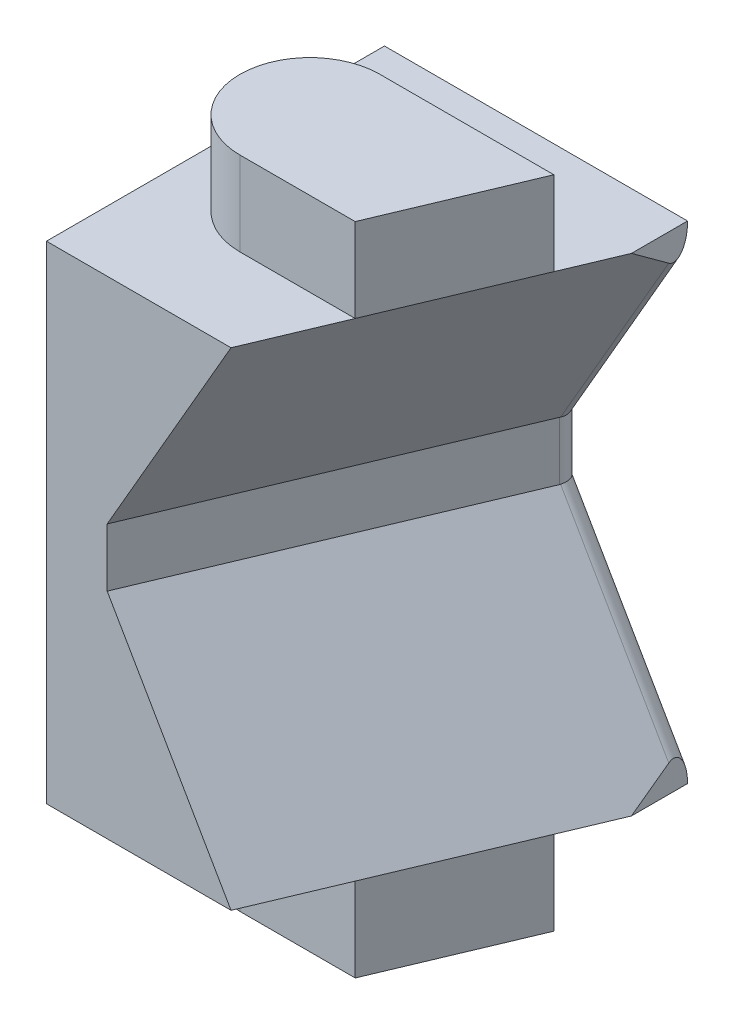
ISO-10303-21;
HEADER;
FILE_DESCRIPTION(('STEP AP214'),'2;1');
FILE_NAME('part.step','',(''),(''),'','','');
FILE_SCHEMA(('AUTOMOTIVE_DESIGN { 1 0 10303 214 1 1 1 1 }'));
ENDSEC;
DATA;
#1=APPLICATION_CONTEXT('core data for automotive mechanical design processes');
#2=APPLICATION_PROTOCOL_DEFINITION('international standard','automotive_design',2000,#1);
#3=PRODUCT_CONTEXT('',#1,'mechanical');
#4=PRODUCT('Part','Part','',(#3));
#5=PRODUCT_RELATED_PRODUCT_CATEGORY('part','',(#4));
#6=PRODUCT_DEFINITION_FORMATION('','',#4);
#7=PRODUCT_DEFINITION_CONTEXT('part definition',#1,'design');
#8=PRODUCT_DEFINITION('design','',#6,#7);
#9=PRODUCT_DEFINITION_SHAPE('','',#8);
#10=(LENGTH_UNIT() NAMED_UNIT(*) SI_UNIT(.MILLI.,.METRE.));
#11=(NAMED_UNIT(*) PLANE_ANGLE_UNIT() SI_UNIT($,.RADIAN.));
#12=(NAMED_UNIT(*) SI_UNIT($,.STERADIAN.) SOLID_ANGLE_UNIT());
#13=UNCERTAINTY_MEASURE_WITH_UNIT(LENGTH_MEASURE(1.E-05),#10,'distance_accuracy_value','');
#14=(GEOMETRIC_REPRESENTATION_CONTEXT(3) GLOBAL_UNCERTAINTY_ASSIGNED_CONTEXT((#13)) GLOBAL_UNIT_ASSIGNED_CONTEXT((#10,
#11,#12)) REPRESENTATION_CONTEXT('',''));
#15=CARTESIAN_POINT('',(0.,0.,0.));
#16=DIRECTION('',(0.,0.,1.));
#17=DIRECTION('',(1.,0.,0.));
#18=AXIS2_PLACEMENT_3D('',#15,#16,#17);
#19=CARTESIAN_POINT('',(11.6726848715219,3.99244557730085,1.2));
#20=DIRECTION('',(0.5,-0.866025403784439,0.));
#21=DIRECTION('',(-0.866025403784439,-0.5,0.));
#22=AXIS2_PLACEMENT_3D('',#19,#20,#21);
#23=CYLINDRICAL_SURFACE('',#22,1.2);
#24=CARTESIAN_POINT('',(15.5938548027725,-2.79921996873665,1.2));
#25=DIRECTION('',(0.258819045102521,-0.965925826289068,0.));
#26=DIRECTION('',(0.965925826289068,0.258819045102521,0.));
#27=AXIS2_PLACEMENT_3D('',#24,#25,#26);
#28=ELLIPSE('',#27,1.2423314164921,1.2);
#29=CARTESIAN_POINT('',(16.7214859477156,-2.49707211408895,1.61042417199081));
#30=VERTEX_POINT('',#29);
#31=CARTESIAN_POINT('',(15.5938548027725,-2.79921996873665,0.));
#32=VERTEX_POINT('',#31);
#33=EDGE_CURVE('E211',#30,#32,#28,.F.);
#34=ORIENTED_EDGE('',*,*,#33,.F.);
#35=DIRECTION('',(0.5,-0.866025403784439,0.));
#36=VECTOR('',#35,1.);
#37=CARTESIAN_POINT('',(22.9635991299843,-13.3087292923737,1.61042417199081));
#38=LINE('',#37,#36);
#39=CARTESIAN_POINT('',(26.,-18.5679298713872,1.61042417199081));
#40=VERTEX_POINT('',#39);
#41=EDGE_CURVE('E264',#40,#30,#38,.F.);
#42=ORIENTED_EDGE('',*,*,#41,.F.);
#43=CARTESIAN_POINT('',(26.,-20.8231921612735,1.2));
#44=DIRECTION('',(1.,0.,0.));
#45=DIRECTION('',(0.,-1.,0.));
#46=AXIS2_PLACEMENT_3D('',#43,#44,#45);
#47=ELLIPSE('',#46,2.4,1.2);
#48=CARTESIAN_POINT('',(26.,-20.8231921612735,0.));
#49=VERTEX_POINT('',#48);
#50=EDGE_CURVE('E267',#49,#40,#47,.T.);
#51=ORIENTED_EDGE('',*,*,#50,.F.);
#52=DIRECTION('',(0.5,-0.866025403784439,0.));
#53=VECTOR('',#52,1.);
#54=CARTESIAN_POINT('',(15.5938548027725,-2.79921996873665,0.));
#55=LINE('',#54,#53);
#56=EDGE_CURVE('E236',#32,#49,#55,.T.);
#57=ORIENTED_EDGE('',*,*,#56,.F.);
#58=EDGE_LOOP('',(#34,#42,#51,#57));
#59=FACE_BOUND('',#58,.T.);
#60=ADVANCED_FACE('F14',(#59),#23,.T.);
#61=CARTESIAN_POINT('',(14.0476676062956,0.121145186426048,1.2));
#62=DIRECTION('',(-0.5,-0.866025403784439,0.));
#63=DIRECTION('',(-0.866025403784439,0.5,0.));
#64=AXIS2_PLACEMENT_3D('',#61,#62,#63);
#65=CYLINDRICAL_SURFACE('',#64,1.2);
#66=CARTESIAN_POINT('',(15.5938548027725,2.79921996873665,1.2));
#67=DIRECTION('',(-0.258819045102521,-0.965925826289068,0.));
#68=DIRECTION('',(0.965925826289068,-0.258819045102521,0.));
#69=AXIS2_PLACEMENT_3D('',#66,#67,#68);
#70=ELLIPSE('',#69,1.2423314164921,1.2);
#71=CARTESIAN_POINT('',(15.5938548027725,2.79921996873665,0.));
#72=VERTEX_POINT('',#71);
#73=CARTESIAN_POINT('',(16.7214859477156,2.49707211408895,1.61042417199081));
#74=VERTEX_POINT('',#73);
#75=EDGE_CURVE('E281',#72,#74,#70,.T.);
#76=ORIENTED_EDGE('',*,*,#75,.F.);
#77=DIRECTION('',(-0.5,-0.866025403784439,0.));
#78=VECTOR('',#77,1.);
#79=CARTESIAN_POINT('',(26.,20.8231921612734,0.));
#80=LINE('',#79,#78);
#81=CARTESIAN_POINT('',(26.,20.8231921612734,0.));
#82=VERTEX_POINT('',#81);
#83=EDGE_CURVE('E230',#82,#72,#80,.T.);
#84=ORIENTED_EDGE('',*,*,#83,.F.);
#85=CARTESIAN_POINT('',(26.,20.8231921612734,1.2));
#86=DIRECTION('',(1.,0.,0.));
#87=DIRECTION('',(0.,-1.,0.));
#88=AXIS2_PLACEMENT_3D('',#85,#86,#87);
#89=ELLIPSE('',#88,2.4,1.2);
#90=CARTESIAN_POINT('',(26.,18.5679298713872,1.61042417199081));
#91=VERTEX_POINT('',#90);
#92=EDGE_CURVE('E283',#91,#82,#89,.T.);
#93=ORIENTED_EDGE('',*,*,#92,.F.);
#94=DIRECTION('',(-0.5,-0.866025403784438,0.));
#95=VECTOR('',#94,1.);
#96=CARTESIAN_POINT('',(9.61363366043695,-9.8140891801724,1.61042417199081));
#97=LINE('',#96,#95);
#98=EDGE_CURVE('E299',#74,#91,#97,.F.);
#99=ORIENTED_EDGE('',*,*,#98,.F.);
#100=EDGE_LOOP('',(#76,#84,#93,#99));
#101=FACE_BOUND('',#100,.T.);
#102=ADVANCED_FACE('F374',(#101),#65,.T.);
#103=CARTESIAN_POINT('',(15.5938548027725,4.6,1.2));
#104=DIRECTION('',(0.,-1.,0.));
#105=DIRECTION('',(-1.,0.,0.));
#106=AXIS2_PLACEMENT_3D('',#103,#104,#105);
#107=CYLINDRICAL_SURFACE('',#106,1.2);
#108=ORIENTED_EDGE('',*,*,#75,.T.);
#109=CARTESIAN_POINT('',(15.5938548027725,0.2451933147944,1.2));
#110=DIRECTION('',(0.813797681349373,-0.469846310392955,0.342020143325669));
#111=DIRECTION('',(-0.433147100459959,-0.882748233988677,-0.182041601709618));
#112=AXIS2_PLACEMENT_3D('',#109,#110,#111);
#113=ELLIPSE('',#112,2.55402665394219,1.2);
#114=CARTESIAN_POINT('',(16.7000905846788,2.4997558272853,1.66501870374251));
#115=VERTEX_POINT('',#114);
#116=EDGE_CURVE('E285',#115,#74,#113,.F.);
#117=ORIENTED_EDGE('',*,*,#116,.F.);
#118=DIRECTION('',(0.,-1.,0.));
#119=VECTOR('',#118,1.);
#120=CARTESIAN_POINT('',(16.7000905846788,-11.7,1.66501870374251));
#121=LINE('',#120,#119);
#122=CARTESIAN_POINT('',(16.7000905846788,-2.4997558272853,1.66501870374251));
#123=VERTEX_POINT('',#122);
#124=EDGE_CURVE('E276',#123,#115,#121,.F.);
#125=ORIENTED_EDGE('',*,*,#124,.F.);
#126=CARTESIAN_POINT('',(15.5938548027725,-0.245193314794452,1.2));
#127=DIRECTION('',(0.813797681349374,0.469846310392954,0.342020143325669));
#128=DIRECTION('',(0.433147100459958,-0.882748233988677,0.182041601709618));
#129=AXIS2_PLACEMENT_3D('',#126,#127,#128);
#130=ELLIPSE('',#129,2.55402665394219,1.2);
#131=EDGE_CURVE('E266',#30,#123,#130,.F.);
#132=ORIENTED_EDGE('',*,*,#131,.F.);
#133=ORIENTED_EDGE('',*,*,#33,.T.);
#134=DIRECTION('',(0.,-1.,0.));
#135=VECTOR('',#134,1.);
#136=CARTESIAN_POINT('',(15.5938548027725,20.9,0.));
#137=LINE('',#136,#135);
#138=EDGE_CURVE('E232',#72,#32,#137,.T.);
#139=ORIENTED_EDGE('',*,*,#138,.F.);
#140=EDGE_LOOP('',(#108,#117,#125,#132,#133,#139));
#141=FACE_BOUND('',#140,.T.);
#142=ADVANCED_FACE('F381',(#141),#107,.T.);
#143=CARTESIAN_POINT('',(26.,0.,14.5));
#144=DIRECTION('',(1.,0.,0.));
#145=DIRECTION('',(0.,-1.,0.));
#146=AXIS2_PLACEMENT_3D('',#143,#144,#145);
#147=PLANE('',#146);
#148=DIRECTION('',(0.,0.,-1.));
#149=VECTOR('',#148,1.);
#150=CARTESIAN_POINT('',(26.,20.9,29.));
#151=LINE('',#150,#149);
#152=CARTESIAN_POINT('',(26.,20.9,4.81407918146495));
#153=VERTEX_POINT('',#152);
#154=CARTESIAN_POINT('',(26.,20.9,0.));
#155=VERTEX_POINT('',#154);
#156=EDGE_CURVE('E244',#153,#155,#151,.T.);
#157=ORIENTED_EDGE('',*,*,#156,.F.);
#158=DIRECTION('',(0.,0.588524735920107,0.808479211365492));
#159=VECTOR('',#158,1.);
#160=CARTESIAN_POINT('',(26.,18.5679298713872,1.61042417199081));
#161=LINE('',#160,#159);
#162=EDGE_CURVE('E296',#91,#153,#161,.T.);
#163=ORIENTED_EDGE('',*,*,#162,.F.);
#164=ORIENTED_EDGE('',*,*,#92,.T.);
#165=DIRECTION('',(0.,-1.,0.));
#166=VECTOR('',#165,1.);
#167=CARTESIAN_POINT('',(26.,20.9,0.));
#168=LINE('',#167,#166);
#169=EDGE_CURVE('E233',#155,#82,#168,.T.);
#170=ORIENTED_EDGE('',*,*,#169,.F.);
#171=EDGE_LOOP('',(#157,#163,#164,#170));
#172=FACE_BOUND('',#171,.T.);
#173=ADVANCED_FACE('F422',(#172),#147,.T.);
#174=CARTESIAN_POINT('',(11.3047612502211,-11.7,14.5));
#175=DIRECTION('',(0.921863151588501,0.,0.387515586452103));
#176=DIRECTION('',(-0.387515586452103,0.,0.921863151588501));
#177=AXIS2_PLACEMENT_3D('',#174,#175,#176);
#178=PLANE('',#177);
#179=DIRECTION('',(0.,-1.,0.));
#180=VECTOR('',#179,1.);
#181=CARTESIAN_POINT('',(5.20952250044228,-20.9,29.));
#182=LINE('',#181,#180);
#183=CARTESIAN_POINT('',(5.20952250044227,-2.49574718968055,29.));
#184=VERTEX_POINT('',#183);
#185=CARTESIAN_POINT('',(5.20952250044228,2.49574718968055,29.));
#186=VERTEX_POINT('',#185);
#187=EDGE_CURVE('E228',#184,#186,#182,.F.);
#188=ORIENTED_EDGE('',*,*,#187,.F.);
#189=DIRECTION('',(-0.387515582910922,0.000135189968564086,0.921863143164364));
#190=VECTOR('',#189,1.);
#191=CARTESIAN_POINT('',(16.7000905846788,-2.49975582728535,1.66501870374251));
#192=LINE('',#191,#190);
#193=EDGE_CURVE('E270',#123,#184,#192,.T.);
#194=ORIENTED_EDGE('',*,*,#193,.F.);
#195=ORIENTED_EDGE('',*,*,#124,.T.);
#196=DIRECTION('',(0.387515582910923,0.000135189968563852,-0.921863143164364));
#197=VECTOR('',#196,1.);
#198=CARTESIAN_POINT('',(5.20952250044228,2.49574718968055,29.));
#199=LINE('',#198,#197);
#200=EDGE_CURVE('E288',#186,#115,#199,.T.);
#201=ORIENTED_EDGE('',*,*,#200,.F.);
#202=EDGE_LOOP('',(#188,#194,#195,#201));
#203=FACE_BOUND('',#202,.T.);
#204=ADVANCED_FACE('F324',(#203),#178,.T.);
#205=CARTESIAN_POINT('',(5.55074308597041,-7.46837821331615,14.5));
#206=DIRECTION('',(0.813797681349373,-0.469846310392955,0.342020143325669));
#207=DIRECTION('',(-0.5,-0.866025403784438,0.));
#208=AXIS2_PLACEMENT_3D('',#205,#206,#207);
#209=PLANE('',#208);
#210=ORIENTED_EDGE('',*,*,#200,.T.);
#211=ORIENTED_EDGE('',*,*,#116,.T.);
#212=ORIENTED_EDGE('',*,*,#98,.T.);
#213=ORIENTED_EDGE('',*,*,#162,.T.);
#214=DIRECTION('',(0.387449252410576,0.,-0.921891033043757));
#215=VECTOR('',#214,1.);
#216=CARTESIAN_POINT('',(15.8352228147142,20.9,29.));
#217=LINE('',#216,#215);
#218=CARTESIAN_POINT('',(24.0306170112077,20.9,9.5));
#219=VERTEX_POINT('',#218);
#220=EDGE_CURVE('E18',#219,#153,#217,.T.);
#221=ORIENTED_EDGE('',*,*,#220,.F.);
#222=DIRECTION('',(-0.387449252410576,0.,0.921891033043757));
#223=VECTOR('',#222,1.);
#224=CARTESIAN_POINT('',(18.9872975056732,20.9,21.5));
#225=LINE('',#224,#223);
#226=CARTESIAN_POINT('',(18.9872975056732,20.9,21.5));
#227=VERTEX_POINT('',#226);
#228=EDGE_CURVE('E175',#219,#227,#225,.T.);
#229=ORIENTED_EDGE('',*,*,#228,.T.);
#230=CARTESIAN_POINT('',(15.8352228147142,20.9,29.));
#231=VERTEX_POINT('',#230);
#232=EDGE_CURVE('E246',#231,#227,#217,.T.);
#233=ORIENTED_EDGE('',*,*,#232,.F.);
#234=DIRECTION('',(0.5,0.866025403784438,0.));
#235=VECTOR('',#234,1.);
#236=CARTESIAN_POINT('',(5.20952250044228,2.49574718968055,29.));
#237=LINE('',#236,#235);
#238=EDGE_CURVE('E224',#186,#231,#237,.T.);
#239=ORIENTED_EDGE('',*,*,#238,.F.);
#240=EDGE_LOOP('',(#210,#211,#212,#213,#221,#229,#233,#239));
#241=FACE_BOUND('',#240,.T.);
#242=ADVANCED_FACE('F329',(#241),#209,.T.);
#243=CARTESIAN_POINT('',(26.,0.,14.5));
#244=DIRECTION('',(1.,0.,0.));
#245=DIRECTION('',(0.,-1.,0.));
#246=AXIS2_PLACEMENT_3D('',#243,#244,#245);
#247=PLANE('',#246);
#248=DIRECTION('',(0.,0.,-1.));
#249=VECTOR('',#248,1.);
#250=CARTESIAN_POINT('',(26.,-20.9,0.));
#251=LINE('',#250,#249);
#252=CARTESIAN_POINT('',(26.,-20.9,0.));
#253=VERTEX_POINT('',#252);
#254=CARTESIAN_POINT('',(26.,-20.9,4.8140791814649));
#255=VERTEX_POINT('',#254);
#256=EDGE_CURVE('E257',#253,#255,#251,.F.);
#257=ORIENTED_EDGE('',*,*,#256,.F.);
#258=DIRECTION('',(0.,-1.,0.));
#259=VECTOR('',#258,1.);
#260=CARTESIAN_POINT('',(26.,20.9,0.));
#261=LINE('',#260,#259);
#262=EDGE_CURVE('E238',#49,#253,#261,.T.);
#263=ORIENTED_EDGE('',*,*,#262,.F.);
#264=ORIENTED_EDGE('',*,*,#50,.T.);
#265=DIRECTION('',(0.,0.588524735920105,-0.808479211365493));
#266=VECTOR('',#265,1.);
#267=CARTESIAN_POINT('',(26.,-20.9,4.81407918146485));
#268=LINE('',#267,#266);
#269=EDGE_CURVE('E239',#255,#40,#268,.T.);
#270=ORIENTED_EDGE('',*,*,#269,.F.);
#271=EDGE_LOOP('',(#257,#263,#264,#270));
#272=FACE_BOUND('',#271,.T.);
#273=ADVANCED_FACE('F433',(#272),#247,.T.);
#274=CARTESIAN_POINT('',(18.9007085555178,-15.65444025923,14.5));
#275=DIRECTION('',(0.813797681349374,0.469846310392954,0.342020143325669));
#276=DIRECTION('',(0.5,-0.866025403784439,0.));
#277=AXIS2_PLACEMENT_3D('',#274,#275,#276);
#278=PLANE('',#277);
#279=DIRECTION('',(-0.387449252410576,0.,0.921891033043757));
#280=VECTOR('',#279,1.);
#281=CARTESIAN_POINT('',(26.,-20.9,4.8140791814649));
#282=LINE('',#281,#280);
#283=CARTESIAN_POINT('',(24.0306170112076,-20.9,9.5));
#284=VERTEX_POINT('',#283);
#285=EDGE_CURVE('E219',#255,#284,#282,.T.);
#286=ORIENTED_EDGE('',*,*,#285,.F.);
#287=ORIENTED_EDGE('',*,*,#269,.T.);
#288=ORIENTED_EDGE('',*,*,#41,.T.);
#289=ORIENTED_EDGE('',*,*,#131,.T.);
#290=ORIENTED_EDGE('',*,*,#193,.T.);
#291=DIRECTION('',(-0.5,0.866025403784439,0.));
#292=VECTOR('',#291,1.);
#293=CARTESIAN_POINT('',(15.8352228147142,-20.9,29.));
#294=LINE('',#293,#292);
#295=CARTESIAN_POINT('',(15.8352228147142,-20.9,29.));
#296=VERTEX_POINT('',#295);
#297=EDGE_CURVE('E225',#296,#184,#294,.T.);
#298=ORIENTED_EDGE('',*,*,#297,.F.);
#299=CARTESIAN_POINT('',(18.9872975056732,-20.9,21.5));
#300=VERTEX_POINT('',#299);
#301=EDGE_CURVE('E261',#300,#296,#282,.T.);
#302=ORIENTED_EDGE('',*,*,#301,.F.);
#303=DIRECTION('',(0.387449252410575,0.,-0.921891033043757));
#304=VECTOR('',#303,1.);
#305=CARTESIAN_POINT('',(18.9872975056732,-20.9,21.5));
#306=LINE('',#305,#304);
#307=EDGE_CURVE('E184',#300,#284,#306,.T.);
#308=ORIENTED_EDGE('',*,*,#307,.T.);
#309=EDGE_LOOP('',(#286,#287,#288,#289,#290,#298,#302,#308));
#310=FACE_BOUND('',#309,.T.);
#311=ADVANCED_FACE('F314',(#310),#278,.T.);
#312=CARTESIAN_POINT('',(-0.3,20.9,0.));
#313=DIRECTION('',(0.,0.,-1.));
#314=DIRECTION('',(1.,0.,0.));
#315=AXIS2_PLACEMENT_3D('',#312,#313,#314);
#316=PLANE('',#315);
#317=ORIENTED_EDGE('',*,*,#262,.T.);
#318=DIRECTION('',(-1.,0.,0.));
#319=VECTOR('',#318,1.);
#320=CARTESIAN_POINT('',(-0.3,-20.9,0.));
#321=LINE('',#320,#319);
#322=CARTESIAN_POINT('',(0.,-20.9,0.));
#323=VERTEX_POINT('',#322);
#324=EDGE_CURVE('E223',#323,#253,#321,.F.);
#325=ORIENTED_EDGE('',*,*,#324,.F.);
#326=DIRECTION('',(0.,-1.,0.));
#327=VECTOR('',#326,1.);
#328=CARTESIAN_POINT('',(0.,23.2745305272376,0.));
#329=LINE('',#328,#327);
#330=CARTESIAN_POINT('',(0.,20.9,0.));
#331=VERTEX_POINT('',#330);
#332=EDGE_CURVE('E180',#331,#323,#329,.T.);
#333=ORIENTED_EDGE('',*,*,#332,.F.);
#334=DIRECTION('',(1.,0.,0.));
#335=VECTOR('',#334,1.);
#336=CARTESIAN_POINT('',(-0.3,20.9,0.));
#337=LINE('',#336,#335);
#338=EDGE_CURVE('E229',#155,#331,#337,.F.);
#339=ORIENTED_EDGE('',*,*,#338,.F.);
#340=ORIENTED_EDGE('',*,*,#169,.T.);
#341=ORIENTED_EDGE('',*,*,#83,.T.);
#342=ORIENTED_EDGE('',*,*,#138,.T.);
#343=ORIENTED_EDGE('',*,*,#56,.T.);
#344=EDGE_LOOP('',(#317,#325,#333,#339,#340,#341,#342,#343));
#345=FACE_BOUND('',#344,.T.);
#346=ADVANCED_FACE('F426',(#345),#316,.T.);
#347=CARTESIAN_POINT('',(-0.3,20.9,29.));
#348=DIRECTION('',(0.,1.,0.));
#349=DIRECTION('',(1.,0.,0.));
#350=AXIS2_PLACEMENT_3D('',#347,#348,#349);
#351=PLANE('',#350);
#352=DIRECTION('',(1.,0.,0.));
#353=VECTOR('',#352,1.);
#354=CARTESIAN_POINT('',(9.1,20.9,9.5));
#355=LINE('',#354,#353);
#356=CARTESIAN_POINT('',(9.1,20.9,9.5));
#357=VERTEX_POINT('',#356);
#358=EDGE_CURVE('E412',#357,#219,#355,.T.);
#359=ORIENTED_EDGE('',*,*,#358,.T.);
#360=ORIENTED_EDGE('',*,*,#220,.T.);
#361=ORIENTED_EDGE('',*,*,#156,.T.);
#362=ORIENTED_EDGE('',*,*,#338,.T.);
#363=DIRECTION('',(0.,0.,-1.));
#364=VECTOR('',#363,1.);
#365=CARTESIAN_POINT('',(0.,20.9,14.5));
#366=LINE('',#365,#364);
#367=CARTESIAN_POINT('',(0.,20.9,29.));
#368=VERTEX_POINT('',#367);
#369=EDGE_CURVE('E215',#331,#368,#366,.F.);
#370=ORIENTED_EDGE('',*,*,#369,.T.);
#371=DIRECTION('',(-1.,0.,0.));
#372=VECTOR('',#371,1.);
#373=CARTESIAN_POINT('',(-0.3,20.9,29.));
#374=LINE('',#373,#372);
#375=EDGE_CURVE('E220',#231,#368,#374,.T.);
#376=ORIENTED_EDGE('',*,*,#375,.F.);
#377=ORIENTED_EDGE('',*,*,#232,.T.);
#378=DIRECTION('',(-1.,0.,0.));
#379=VECTOR('',#378,1.);
#380=CARTESIAN_POINT('',(9.1,20.9,21.5));
#381=LINE('',#380,#379);
#382=CARTESIAN_POINT('',(9.1,20.9,21.5));
#383=VERTEX_POINT('',#382);
#384=EDGE_CURVE('E37',#227,#383,#381,.T.);
#385=ORIENTED_EDGE('',*,*,#384,.T.);
#386=CARTESIAN_POINT('',(9.1,20.9,15.5));
#387=DIRECTION('',(0.,1.,0.));
#388=DIRECTION('',(1.,0.,0.));
#389=AXIS2_PLACEMENT_3D('',#386,#387,#388);
#390=CIRCLE('',#389,6.);
#391=EDGE_CURVE('E32',#383,#357,#390,.F.);
#392=ORIENTED_EDGE('',*,*,#391,.T.);
#393=EDGE_LOOP('',(#359,#360,#361,#362,#370,#376,#377,#385,#392));
#394=FACE_BOUND('',#393,.T.);
#395=ADVANCED_FACE('F418',(#394),#351,.T.);
#396=CARTESIAN_POINT('',(-0.3,-20.9,29.));
#397=DIRECTION('',(0.,0.,1.));
#398=DIRECTION('',(-1.,0.,0.));
#399=AXIS2_PLACEMENT_3D('',#396,#397,#398);
#400=PLANE('',#399);
#401=ORIENTED_EDGE('',*,*,#238,.T.);
#402=ORIENTED_EDGE('',*,*,#375,.T.);
#403=DIRECTION('',(0.,-1.,0.));
#404=VECTOR('',#403,1.);
#405=CARTESIAN_POINT('',(0.,0.,29.));
#406=LINE('',#405,#404);
#407=CARTESIAN_POINT('',(0.,-20.9,29.));
#408=VERTEX_POINT('',#407);
#409=EDGE_CURVE('E24',#368,#408,#406,.T.);
#410=ORIENTED_EDGE('',*,*,#409,.T.);
#411=DIRECTION('',(-1.,0.,0.));
#412=VECTOR('',#411,1.);
#413=CARTESIAN_POINT('',(-0.3,-20.9,29.));
#414=LINE('',#413,#412);
#415=EDGE_CURVE('E217',#296,#408,#414,.T.);
#416=ORIENTED_EDGE('',*,*,#415,.F.);
#417=ORIENTED_EDGE('',*,*,#297,.T.);
#418=ORIENTED_EDGE('',*,*,#187,.T.);
#419=EDGE_LOOP('',(#401,#402,#410,#416,#417,#418));
#420=FACE_BOUND('',#419,.T.);
#421=ADVANCED_FACE('F322',(#420),#400,.T.);
#422=CARTESIAN_POINT('',(-0.3,-20.9,0.));
#423=DIRECTION('',(0.,-1.,0.));
#424=DIRECTION('',(-1.,0.,0.));
#425=AXIS2_PLACEMENT_3D('',#422,#423,#424);
#426=PLANE('',#425);
#427=ORIENTED_EDGE('',*,*,#324,.T.);
#428=ORIENTED_EDGE('',*,*,#256,.T.);
#429=ORIENTED_EDGE('',*,*,#285,.T.);
#430=DIRECTION('',(-1.,0.,0.));
#431=VECTOR('',#430,1.);
#432=CARTESIAN_POINT('',(9.1,-20.9,9.5));
#433=LINE('',#432,#431);
#434=CARTESIAN_POINT('',(9.1,-20.9,9.5));
#435=VERTEX_POINT('',#434);
#436=EDGE_CURVE('E192',#284,#435,#433,.T.);
#437=ORIENTED_EDGE('',*,*,#436,.T.);
#438=CARTESIAN_POINT('',(9.1,-20.9,15.5));
#439=DIRECTION('',(0.,-1.,0.));
#440=DIRECTION('',(-1.,0.,0.));
#441=AXIS2_PLACEMENT_3D('',#438,#439,#440);
#442=CIRCLE('',#441,6.);
#443=CARTESIAN_POINT('',(9.1,-20.9,21.5));
#444=VERTEX_POINT('',#443);
#445=EDGE_CURVE('E190',#435,#444,#442,.F.);
#446=ORIENTED_EDGE('',*,*,#445,.T.);
#447=DIRECTION('',(1.,0.,0.));
#448=VECTOR('',#447,1.);
#449=CARTESIAN_POINT('',(9.1,-20.9,21.5));
#450=LINE('',#449,#448);
#451=EDGE_CURVE('E187',#444,#300,#450,.T.);
#452=ORIENTED_EDGE('',*,*,#451,.T.);
#453=ORIENTED_EDGE('',*,*,#301,.T.);
#454=ORIENTED_EDGE('',*,*,#415,.T.);
#455=DIRECTION('',(0.,0.,-1.));
#456=VECTOR('',#455,1.);
#457=CARTESIAN_POINT('',(0.,-20.9,14.5));
#458=LINE('',#457,#456);
#459=EDGE_CURVE('E9',#408,#323,#458,.T.);
#460=ORIENTED_EDGE('',*,*,#459,.T.);
#461=EDGE_LOOP('',(#427,#428,#429,#437,#446,#452,#453,#454,#460));
#462=FACE_BOUND('',#461,.T.);
#463=ADVANCED_FACE('F339',(#462),#426,.T.);
#464=CARTESIAN_POINT('',(0.,0.,14.5));
#465=DIRECTION('',(1.,0.,0.));
#466=DIRECTION('',(0.,-1.,0.));
#467=AXIS2_PLACEMENT_3D('',#464,#465,#466);
#468=PLANE('',#467);
#469=ORIENTED_EDGE('',*,*,#409,.F.);
#470=ORIENTED_EDGE('',*,*,#369,.F.);
#471=ORIENTED_EDGE('',*,*,#332,.T.);
#472=ORIENTED_EDGE('',*,*,#459,.F.);
#473=EDGE_LOOP('',(#469,#470,#471,#472));
#474=FACE_BOUND('',#473,.T.);
#475=ADVANCED_FACE('F336',(#474),#468,.F.);
#476=CARTESIAN_POINT('',(9.1,3.22655649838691,15.5));
#477=DIRECTION('',(0.,-1.,0.));
#478=DIRECTION('',(-1.,0.,0.));
#479=AXIS2_PLACEMENT_3D('',#476,#477,#478);
#480=CYLINDRICAL_SURFACE('',#479,6.);
#481=ORIENTED_EDGE('',*,*,#445,.F.);
#482=DIRECTION('',(0.,-1.,0.));
#483=VECTOR('',#482,1.);
#484=CARTESIAN_POINT('',(9.1,3.22655649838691,9.5));
#485=LINE('',#484,#483);
#486=CARTESIAN_POINT('',(9.1,-28.1,9.5));
#487=VERTEX_POINT('',#486);
#488=EDGE_CURVE('E204',#435,#487,#485,.T.);
#489=ORIENTED_EDGE('',*,*,#488,.T.);
#490=CARTESIAN_POINT('',(9.1,-28.1,15.5));
#491=DIRECTION('',(0.,-1.,0.));
#492=DIRECTION('',(-1.,0.,0.));
#493=AXIS2_PLACEMENT_3D('',#490,#491,#492);
#494=CIRCLE('',#493,6.);
#495=CARTESIAN_POINT('',(9.1,-28.1,21.5));
#496=VERTEX_POINT('',#495);
#497=EDGE_CURVE('E183',#496,#487,#494,.T.);
#498=ORIENTED_EDGE('',*,*,#497,.F.);
#499=DIRECTION('',(0.,-1.,0.));
#500=VECTOR('',#499,1.);
#501=CARTESIAN_POINT('',(9.1,3.22655649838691,21.5));
#502=LINE('',#501,#500);
#503=EDGE_CURVE('E188',#444,#496,#502,.T.);
#504=ORIENTED_EDGE('',*,*,#503,.F.);
#505=EDGE_LOOP('',(#481,#489,#498,#504));
#506=FACE_BOUND('',#505,.T.);
#507=ADVANCED_FACE('F361',(#506),#480,.T.);
#508=CARTESIAN_POINT('',(9.1,3.22655649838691,21.5));
#509=DIRECTION('',(0.,0.,1.));
#510=DIRECTION('',(-1.,0.,0.));
#511=AXIS2_PLACEMENT_3D('',#508,#509,#510);
#512=PLANE('',#511);
#513=ORIENTED_EDGE('',*,*,#451,.F.);
#514=ORIENTED_EDGE('',*,*,#503,.T.);
#515=DIRECTION('',(-1.,0.,0.));
#516=VECTOR('',#515,1.);
#517=CARTESIAN_POINT('',(9.1,-28.1,21.5));
#518=LINE('',#517,#516);
#519=CARTESIAN_POINT('',(18.9872975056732,-28.1,21.5));
#520=VERTEX_POINT('',#519);
#521=EDGE_CURVE('E201',#520,#496,#518,.T.);
#522=ORIENTED_EDGE('',*,*,#521,.F.);
#523=DIRECTION('',(0.,-1.,0.));
#524=VECTOR('',#523,1.);
#525=CARTESIAN_POINT('',(18.9872975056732,3.22655649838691,21.5));
#526=LINE('',#525,#524);
#527=EDGE_CURVE('E206',#300,#520,#526,.T.);
#528=ORIENTED_EDGE('',*,*,#527,.F.);
#529=EDGE_LOOP('',(#513,#514,#522,#528));
#530=FACE_BOUND('',#529,.T.);
#531=ADVANCED_FACE('F350',(#530),#512,.T.);
#532=CARTESIAN_POINT('',(18.9872975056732,3.22655649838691,21.5));
#533=DIRECTION('',(0.921891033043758,0.,0.387449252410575));
#534=DIRECTION('',(-0.387449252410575,0.,0.921891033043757));
#535=AXIS2_PLACEMENT_3D('',#532,#533,#534);
#536=PLANE('',#535);
#537=ORIENTED_EDGE('',*,*,#307,.F.);
#538=ORIENTED_EDGE('',*,*,#527,.T.);
#539=DIRECTION('',(-0.387449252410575,0.,0.921891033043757));
#540=VECTOR('',#539,1.);
#541=CARTESIAN_POINT('',(18.9872975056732,-28.1,21.5));
#542=LINE('',#541,#540);
#543=CARTESIAN_POINT('',(24.0306170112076,-28.1,9.5));
#544=VERTEX_POINT('',#543);
#545=EDGE_CURVE('E198',#544,#520,#542,.T.);
#546=ORIENTED_EDGE('',*,*,#545,.F.);
#547=DIRECTION('',(0.,-1.,0.));
#548=VECTOR('',#547,1.);
#549=CARTESIAN_POINT('',(24.0306170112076,3.22655649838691,9.5));
#550=LINE('',#549,#548);
#551=EDGE_CURVE('E208',#284,#544,#550,.T.);
#552=ORIENTED_EDGE('',*,*,#551,.F.);
#553=EDGE_LOOP('',(#537,#538,#546,#552));
#554=FACE_BOUND('',#553,.T.);
#555=ADVANCED_FACE('F345',(#554),#536,.T.);
#556=CARTESIAN_POINT('',(9.1,3.22655649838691,9.5));
#557=DIRECTION('',(0.,0.,-1.));
#558=DIRECTION('',(1.,0.,0.));
#559=AXIS2_PLACEMENT_3D('',#556,#557,#558);
#560=PLANE('',#559);
#561=ORIENTED_EDGE('',*,*,#436,.F.);
#562=ORIENTED_EDGE('',*,*,#551,.T.);
#563=DIRECTION('',(1.,0.,0.));
#564=VECTOR('',#563,1.);
#565=CARTESIAN_POINT('',(9.1,-28.1,9.5));
#566=LINE('',#565,#564);
#567=EDGE_CURVE('E195',#487,#544,#566,.T.);
#568=ORIENTED_EDGE('',*,*,#567,.F.);
#569=ORIENTED_EDGE('',*,*,#488,.F.);
#570=EDGE_LOOP('',(#561,#562,#568,#569));
#571=FACE_BOUND('',#570,.T.);
#572=ADVANCED_FACE('F358',(#571),#560,.T.);
#573=CARTESIAN_POINT('',(9.52744576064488,-28.1,15.5));
#574=DIRECTION('',(0.,-1.,0.));
#575=DIRECTION('',(-1.,0.,0.));
#576=AXIS2_PLACEMENT_3D('',#573,#574,#575);
#577=PLANE('',#576);
#578=ORIENTED_EDGE('',*,*,#497,.T.);
#579=ORIENTED_EDGE('',*,*,#567,.T.);
#580=ORIENTED_EDGE('',*,*,#545,.T.);
#581=ORIENTED_EDGE('',*,*,#521,.T.);
#582=EDGE_LOOP('',(#578,#579,#580,#581));
#583=FACE_BOUND('',#582,.T.);
#584=ADVANCED_FACE('F354',(#583),#577,.T.);
#585=CARTESIAN_POINT('',(9.1,-3.22655649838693,15.5));
#586=DIRECTION('',(0.,1.,0.));
#587=DIRECTION('',(1.,0.,0.));
#588=AXIS2_PLACEMENT_3D('',#585,#586,#587);
#589=CYLINDRICAL_SURFACE('',#588,6.);
#590=ORIENTED_EDGE('',*,*,#391,.F.);
#591=DIRECTION('',(0.,1.,0.));
#592=VECTOR('',#591,1.);
#593=CARTESIAN_POINT('',(9.1,-3.22655649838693,21.5));
#594=LINE('',#593,#592);
#595=CARTESIAN_POINT('',(9.1,28.1,21.5));
#596=VERTEX_POINT('',#595);
#597=EDGE_CURVE('E146',#383,#596,#594,.T.);
#598=ORIENTED_EDGE('',*,*,#597,.T.);
#599=CARTESIAN_POINT('',(9.1,28.1,15.5));
#600=DIRECTION('',(0.,1.,0.));
#601=DIRECTION('',(1.,0.,0.));
#602=AXIS2_PLACEMENT_3D('',#599,#600,#601);
#603=CIRCLE('',#602,6.);
#604=CARTESIAN_POINT('',(9.1,28.1,9.5));
#605=VERTEX_POINT('',#604);
#606=EDGE_CURVE('E151',#605,#596,#603,.T.);
#607=ORIENTED_EDGE('',*,*,#606,.F.);
#608=DIRECTION('',(0.,1.,0.));
#609=VECTOR('',#608,1.);
#610=CARTESIAN_POINT('',(9.1,-3.22655649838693,9.5));
#611=LINE('',#610,#609);
#612=EDGE_CURVE('E173',#357,#605,#611,.T.);
#613=ORIENTED_EDGE('',*,*,#612,.F.);
#614=EDGE_LOOP('',(#590,#598,#607,#613));
#615=FACE_BOUND('',#614,.T.);
#616=ADVANCED_FACE('F148',(#615),#589,.T.);
#617=CARTESIAN_POINT('',(9.1,-3.22655649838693,9.5));
#618=DIRECTION('',(0.,0.,-1.));
#619=DIRECTION('',(1.,0.,0.));
#620=AXIS2_PLACEMENT_3D('',#617,#618,#619);
#621=PLANE('',#620);
#622=ORIENTED_EDGE('',*,*,#358,.F.);
#623=ORIENTED_EDGE('',*,*,#612,.T.);
#624=DIRECTION('',(-1.,0.,0.));
#625=VECTOR('',#624,1.);
#626=CARTESIAN_POINT('',(9.1,28.1,9.5));
#627=LINE('',#626,#625);
#628=CARTESIAN_POINT('',(24.0306170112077,28.1,9.5));
#629=VERTEX_POINT('',#628);
#630=EDGE_CURVE('E155',#629,#605,#627,.T.);
#631=ORIENTED_EDGE('',*,*,#630,.F.);
#632=DIRECTION('',(0.,1.,0.));
#633=VECTOR('',#632,1.);
#634=CARTESIAN_POINT('',(24.0306170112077,-3.22655649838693,9.5));
#635=LINE('',#634,#633);
#636=EDGE_CURVE('E176',#219,#629,#635,.T.);
#637=ORIENTED_EDGE('',*,*,#636,.F.);
#638=EDGE_LOOP('',(#622,#623,#631,#637));
#639=FACE_BOUND('',#638,.T.);
#640=ADVANCED_FACE('F392',(#639),#621,.T.);
#641=CARTESIAN_POINT('',(18.9872975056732,-3.22655649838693,21.5));
#642=DIRECTION('',(0.921891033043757,0.,0.387449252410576));
#643=DIRECTION('',(-0.387449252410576,0.,0.921891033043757));
#644=AXIS2_PLACEMENT_3D('',#641,#642,#643);
#645=PLANE('',#644);
#646=ORIENTED_EDGE('',*,*,#228,.F.);
#647=ORIENTED_EDGE('',*,*,#636,.T.);
#648=DIRECTION('',(0.387449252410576,0.,-0.921891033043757));
#649=VECTOR('',#648,1.);
#650=CARTESIAN_POINT('',(18.9872975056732,28.1,21.5));
#651=LINE('',#650,#649);
#652=CARTESIAN_POINT('',(18.9872975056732,28.1,21.5));
#653=VERTEX_POINT('',#652);
#654=EDGE_CURVE('E164',#653,#629,#651,.T.);
#655=ORIENTED_EDGE('',*,*,#654,.F.);
#656=DIRECTION('',(0.,1.,0.));
#657=VECTOR('',#656,1.);
#658=CARTESIAN_POINT('',(18.9872975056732,-3.22655649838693,21.5));
#659=LINE('',#658,#657);
#660=EDGE_CURVE('E154',#227,#653,#659,.T.);
#661=ORIENTED_EDGE('',*,*,#660,.F.);
#662=EDGE_LOOP('',(#646,#647,#655,#661));
#663=FACE_BOUND('',#662,.T.);
#664=ADVANCED_FACE('F402',(#663),#645,.T.);
#665=CARTESIAN_POINT('',(9.1,-3.22655649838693,21.5));
#666=DIRECTION('',(0.,0.,1.));
#667=DIRECTION('',(-1.,0.,0.));
#668=AXIS2_PLACEMENT_3D('',#665,#666,#667);
#669=PLANE('',#668);
#670=ORIENTED_EDGE('',*,*,#384,.F.);
#671=ORIENTED_EDGE('',*,*,#660,.T.);
#672=DIRECTION('',(1.,0.,0.));
#673=VECTOR('',#672,1.);
#674=CARTESIAN_POINT('',(9.1,28.1,21.5));
#675=LINE('',#674,#673);
#676=EDGE_CURVE('E158',#596,#653,#675,.T.);
#677=ORIENTED_EDGE('',*,*,#676,.F.);
#678=ORIENTED_EDGE('',*,*,#597,.F.);
#679=EDGE_LOOP('',(#670,#671,#677,#678));
#680=FACE_BOUND('',#679,.T.);
#681=ADVANCED_FACE('F159',(#680),#669,.T.);
#682=CARTESIAN_POINT('',(13.2,28.1,11.65));
#683=DIRECTION('',(0.,1.,0.));
#684=DIRECTION('',(-1.,0.,0.));
#685=AXIS2_PLACEMENT_3D('',#682,#683,#684);
#686=PLANE('',#685);
#687=ORIENTED_EDGE('',*,*,#606,.T.);
#688=ORIENTED_EDGE('',*,*,#676,.T.);
#689=ORIENTED_EDGE('',*,*,#654,.T.);
#690=ORIENTED_EDGE('',*,*,#630,.T.);
#691=EDGE_LOOP('',(#687,#688,#689,#690));
#692=FACE_BOUND('',#691,.T.);
#693=ADVANCED_FACE('F16',(#692),#686,.T.);
#694=CLOSED_SHELL('',(#60,#102,#142,#173,#204,#242,#273,#311,#346,#395,#421,#463,#475,#507,#531,
#555,#572,#584,#616,#640,#664,#681,#693));
#695=MANIFOLD_SOLID_BREP('B1',#694);
#696=ADVANCED_BREP_SHAPE_REPRESENTATION('',(#18,#695),#14);
#697=SHAPE_DEFINITION_REPRESENTATION(#9,#696);
ENDSEC;
END-ISO-10303-21;
